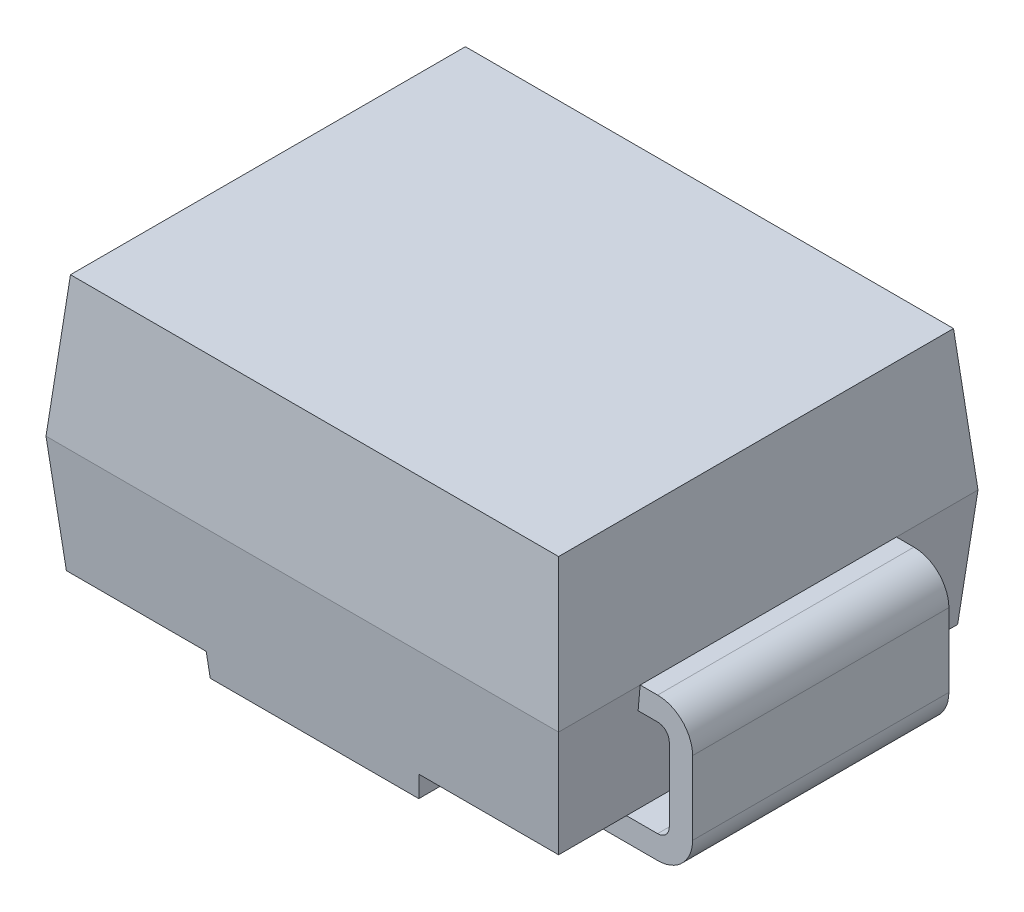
ISO-10303-21;
HEADER;
FILE_DESCRIPTION(('STEP AP214'),'2;1');
FILE_NAME('part.step','',(''),(''),'','','');
FILE_SCHEMA(('AUTOMOTIVE_DESIGN { 1 0 10303 214 1 1 1 1 }'));
ENDSEC;
DATA;
#1=APPLICATION_CONTEXT('core data for automotive mechanical design processes');
#2=APPLICATION_PROTOCOL_DEFINITION('international standard','automotive_design',2000,#1);
#3=PRODUCT_CONTEXT('',#1,'mechanical');
#4=PRODUCT('Part','Part','',(#3));
#5=PRODUCT_RELATED_PRODUCT_CATEGORY('part','',(#4));
#6=PRODUCT_DEFINITION_FORMATION('','',#4);
#7=PRODUCT_DEFINITION_CONTEXT('part definition',#1,'design');
#8=PRODUCT_DEFINITION('design','',#6,#7);
#9=PRODUCT_DEFINITION_SHAPE('','',#8);
#10=(LENGTH_UNIT() NAMED_UNIT(*) SI_UNIT(.MILLI.,.METRE.));
#11=(NAMED_UNIT(*) PLANE_ANGLE_UNIT() SI_UNIT($,.RADIAN.));
#12=(NAMED_UNIT(*) SI_UNIT($,.STERADIAN.) SOLID_ANGLE_UNIT());
#13=UNCERTAINTY_MEASURE_WITH_UNIT(LENGTH_MEASURE(1.E-05),#10,'distance_accuracy_value','');
#14=(GEOMETRIC_REPRESENTATION_CONTEXT(3) GLOBAL_UNCERTAINTY_ASSIGNED_CONTEXT((#13)) GLOBAL_UNIT_ASSIGNED_CONTEXT((#10,
#11,#12)) REPRESENTATION_CONTEXT('',''));
#15=CARTESIAN_POINT('',(0.,0.,0.));
#16=DIRECTION('',(0.,0.,1.));
#17=DIRECTION('',(1.,0.,0.));
#18=AXIS2_PLACEMENT_3D('',#15,#16,#17);
#19=CARTESIAN_POINT('',(2.2,0.,0.));
#20=DIRECTION('',(0.996194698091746,-0.0871557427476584,0.));
#21=DIRECTION('',(0.0871557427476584,0.996194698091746,0.));
#22=AXIS2_PLACEMENT_3D('',#19,#20,#21);
#23=PLANE('',#22);
#24=DIRECTION('',(0.0871557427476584,0.996194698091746,0.));
#25=VECTOR('',#24,1.);
#26=CARTESIAN_POINT('',(2.2,0.,1.1));
#27=LINE('',#26,#25);
#28=CARTESIAN_POINT('',(2.2,0.,1.1));
#29=VERTEX_POINT('',#28);
#30=CARTESIAN_POINT('',(2.18250226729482,-0.2,1.1));
#31=VERTEX_POINT('',#30);
#32=EDGE_CURVE('E431',#29,#31,#27,.F.);
#33=ORIENTED_EDGE('',*,*,#32,.F.);
#34=DIRECTION('',(0.,0.,1.));
#35=VECTOR('',#34,1.);
#36=CARTESIAN_POINT('',(2.2,0.,0.));
#37=LINE('',#36,#35);
#38=CARTESIAN_POINT('',(2.2,0.,1.8));
#39=VERTEX_POINT('',#38);
#40=EDGE_CURVE('E384',#29,#39,#37,.T.);
#41=ORIENTED_EDGE('',*,*,#40,.T.);
#42=DIRECTION('',(0.0868265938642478,0.992432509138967,0.0868265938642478));
#43=VECTOR('',#42,1.);
#44=CARTESIAN_POINT('',(2.14901194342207,-0.582796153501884,1.74901194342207));
#45=LINE('',#44,#43);
#46=CARTESIAN_POINT('',(2.11251133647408,-1.,1.71251133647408));
#47=VERTEX_POINT('',#46);
#48=EDGE_CURVE('E354',#47,#39,#45,.T.);
#49=ORIENTED_EDGE('',*,*,#48,.F.);
#50=DIRECTION('',(0.,0.,-1.));
#51=VECTOR('',#50,1.);
#52=CARTESIAN_POINT('',(2.11251133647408,-1.,0.));
#53=LINE('',#52,#51);
#54=CARTESIAN_POINT('',(2.11251133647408,-1.,-1.71251133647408));
#55=VERTEX_POINT('',#54);
#56=EDGE_CURVE('E359',#55,#47,#53,.F.);
#57=ORIENTED_EDGE('',*,*,#56,.F.);
#58=DIRECTION('',(-0.0868265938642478,-0.992432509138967,0.0868265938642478));
#59=VECTOR('',#58,1.);
#60=CARTESIAN_POINT('',(2.14901194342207,-0.582796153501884,-1.74901194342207));
#61=LINE('',#60,#59);
#62=CARTESIAN_POINT('',(2.2,0.,-1.8));
#63=VERTEX_POINT('',#62);
#64=EDGE_CURVE('E351',#55,#63,#61,.F.);
#65=ORIENTED_EDGE('',*,*,#64,.T.);
#66=CARTESIAN_POINT('',(2.2,0.,-1.1));
#67=VERTEX_POINT('',#66);
#68=EDGE_CURVE('E385',#63,#67,#37,.T.);
#69=ORIENTED_EDGE('',*,*,#68,.T.);
#70=DIRECTION('',(0.0871557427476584,0.996194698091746,0.));
#71=VECTOR('',#70,1.);
#72=CARTESIAN_POINT('',(2.2,0.,-1.1));
#73=LINE('',#72,#71);
#74=CARTESIAN_POINT('',(2.18250226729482,-0.2,-1.1));
#75=VERTEX_POINT('',#74);
#76=EDGE_CURVE('E425',#67,#75,#73,.F.);
#77=ORIENTED_EDGE('',*,*,#76,.T.);
#78=DIRECTION('',(0.,0.,1.));
#79=VECTOR('',#78,1.);
#80=CARTESIAN_POINT('',(2.18250226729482,-0.2,0.));
#81=LINE('',#80,#79);
#82=EDGE_CURVE('E428',#31,#75,#81,.F.);
#83=ORIENTED_EDGE('',*,*,#82,.F.);
#84=EDGE_LOOP('',(#33,#41,#49,#57,#65,#69,#77,#83));
#85=FACE_BOUND('',#84,.T.);
#86=ADVANCED_FACE('F15',(#85),#23,.T.);
#87=CARTESIAN_POINT('',(-4.5633666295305,-1.,0.));
#88=DIRECTION('',(0.,1.,0.));
#89=DIRECTION('',(0.,0.,1.));
#90=AXIS2_PLACEMENT_3D('',#87,#88,#89);
#91=PLANE('',#90);
#92=DIRECTION('',(0.,0.,-1.));
#93=VECTOR('',#92,1.);
#94=CARTESIAN_POINT('',(0.912511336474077,-1.,0.));
#95=LINE('',#94,#93);
#96=CARTESIAN_POINT('',(0.912511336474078,-1.,-1.71251133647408));
#97=VERTEX_POINT('',#96);
#98=CARTESIAN_POINT('',(0.912511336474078,-1.,1.71251133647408));
#99=VERTEX_POINT('',#98);
#100=EDGE_CURVE('E415',#97,#99,#95,.F.);
#101=ORIENTED_EDGE('',*,*,#100,.F.);
#102=DIRECTION('',(-1.,0.,0.));
#103=VECTOR('',#102,1.);
#104=CARTESIAN_POINT('',(-4.5633666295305,-1.,-1.71251133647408));
#105=LINE('',#104,#103);
#106=EDGE_CURVE('E364',#55,#97,#105,.T.);
#107=ORIENTED_EDGE('',*,*,#106,.F.);
#108=ORIENTED_EDGE('',*,*,#56,.T.);
#109=DIRECTION('',(1.,0.,0.));
#110=VECTOR('',#109,1.);
#111=CARTESIAN_POINT('',(-4.5633666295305,-1.,1.71251133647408));
#112=LINE('',#111,#110);
#113=EDGE_CURVE('E369',#47,#99,#112,.F.);
#114=ORIENTED_EDGE('',*,*,#113,.T.);
#115=EDGE_LOOP('',(#101,#107,#108,#114));
#116=FACE_BOUND('',#115,.T.);
#117=ADVANCED_FACE('F517',(#116),#91,.F.);
#118=DIRECTION('',(0.,0.,1.));
#119=VECTOR('',#118,1.);
#120=CARTESIAN_POINT('',(-0.912511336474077,-1.,0.));
#121=LINE('',#120,#119);
#122=CARTESIAN_POINT('',(-0.912511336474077,-1.,1.71251133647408));
#123=VERTEX_POINT('',#122);
#124=CARTESIAN_POINT('',(-0.912511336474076,-1.,-1.71251133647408));
#125=VERTEX_POINT('',#124);
#126=EDGE_CURVE('E393',#123,#125,#121,.F.);
#127=ORIENTED_EDGE('',*,*,#126,.F.);
#128=CARTESIAN_POINT('',(-2.11251133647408,-1.,1.71251133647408));
#129=VERTEX_POINT('',#128);
#130=EDGE_CURVE('E372',#123,#129,#112,.F.);
#131=ORIENTED_EDGE('',*,*,#130,.T.);
#132=DIRECTION('',(0.,0.,1.));
#133=VECTOR('',#132,1.);
#134=CARTESIAN_POINT('',(-2.11251133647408,-1.,0.));
#135=LINE('',#134,#133);
#136=CARTESIAN_POINT('',(-2.11251133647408,-1.,-1.71251133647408));
#137=VERTEX_POINT('',#136);
#138=EDGE_CURVE('E367',#137,#129,#135,.T.);
#139=ORIENTED_EDGE('',*,*,#138,.F.);
#140=EDGE_CURVE('E335',#125,#137,#105,.T.);
#141=ORIENTED_EDGE('',*,*,#140,.F.);
#142=EDGE_LOOP('',(#127,#131,#139,#141));
#143=FACE_BOUND('',#142,.T.);
#144=ADVANCED_FACE('F524',(#143),#91,.F.);
#145=CARTESIAN_POINT('',(-4.5633666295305,0.,-1.8));
#146=DIRECTION('',(0.,0.0871557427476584,-0.996194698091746));
#147=DIRECTION('',(0.,0.996194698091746,0.0871557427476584));
#148=AXIS2_PLACEMENT_3D('',#145,#146,#147);
#149=PLANE('',#148);
#150=DIRECTION('',(-1.,0.,0.));
#151=VECTOR('',#150,1.);
#152=CARTESIAN_POINT('',(-4.5633666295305,0.,-1.8));
#153=LINE('',#152,#151);
#154=CARTESIAN_POINT('',(-2.2,0.,-1.8));
#155=VERTEX_POINT('',#154);
#156=EDGE_CURVE('E353',#63,#155,#153,.T.);
#157=ORIENTED_EDGE('',*,*,#156,.T.);
#158=DIRECTION('',(-0.0868265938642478,-0.992432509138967,-0.0868265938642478));
#159=VECTOR('',#158,1.);
#160=CARTESIAN_POINT('',(-2.18643005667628,0.155105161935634,-1.78643005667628));
#161=LINE('',#160,#159);
#162=CARTESIAN_POINT('',(-2.09501360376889,1.2,-1.69501360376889));
#163=VERTEX_POINT('',#162);
#164=EDGE_CURVE('E390',#163,#155,#161,.T.);
#165=ORIENTED_EDGE('',*,*,#164,.F.);
#166=DIRECTION('',(1.,0.,0.));
#167=VECTOR('',#166,1.);
#168=CARTESIAN_POINT('',(-4.5633666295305,1.2,-1.69501360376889));
#169=LINE('',#168,#167);
#170=CARTESIAN_POINT('',(2.09501360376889,1.2,-1.69501360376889));
#171=VERTEX_POINT('',#170);
#172=EDGE_CURVE('E388',#171,#163,#169,.F.);
#173=ORIENTED_EDGE('',*,*,#172,.F.);
#174=DIRECTION('',(-0.0868265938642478,0.992432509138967,0.0868265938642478));
#175=VECTOR('',#174,1.);
#176=CARTESIAN_POINT('',(2.18643005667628,0.155105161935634,-1.78643005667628));
#177=LINE('',#176,#175);
#178=EDGE_CURVE('E395',#171,#63,#177,.F.);
#179=ORIENTED_EDGE('',*,*,#178,.T.);
#180=EDGE_LOOP('',(#157,#165,#173,#179));
#181=FACE_BOUND('',#180,.T.);
#182=ADVANCED_FACE('F538',(#181),#149,.T.);
#183=CARTESIAN_POINT('',(-2.2,0.,0.));
#184=DIRECTION('',(-0.996194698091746,0.0871557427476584,0.));
#185=DIRECTION('',(-0.0871557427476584,-0.996194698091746,0.));
#186=AXIS2_PLACEMENT_3D('',#183,#184,#185);
#187=PLANE('',#186);
#188=DIRECTION('',(0.,0.,1.));
#189=VECTOR('',#188,1.);
#190=CARTESIAN_POINT('',(-2.2,0.,0.));
#191=LINE('',#190,#189);
#192=CARTESIAN_POINT('',(-2.2,0.,-1.1));
#193=VERTEX_POINT('',#192);
#194=EDGE_CURVE('E377',#155,#193,#191,.T.);
#195=ORIENTED_EDGE('',*,*,#194,.T.);
#196=CARTESIAN_POINT('',(-2.2,0.,1.1));
#197=VERTEX_POINT('',#196);
#198=EDGE_CURVE('E381',#193,#197,#191,.T.);
#199=ORIENTED_EDGE('',*,*,#198,.T.);
#200=CARTESIAN_POINT('',(-2.2,0.,1.8));
#201=VERTEX_POINT('',#200);
#202=EDGE_CURVE('E376',#197,#201,#191,.T.);
#203=ORIENTED_EDGE('',*,*,#202,.T.);
#204=DIRECTION('',(0.0868265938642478,0.992432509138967,-0.0868265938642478));
#205=VECTOR('',#204,1.);
#206=CARTESIAN_POINT('',(-2.18643005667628,0.155105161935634,1.78643005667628));
#207=LINE('',#206,#205);
#208=CARTESIAN_POINT('',(-2.09501360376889,1.2,1.69501360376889));
#209=VERTEX_POINT('',#208);
#210=EDGE_CURVE('E394',#209,#201,#207,.F.);
#211=ORIENTED_EDGE('',*,*,#210,.F.);
#212=DIRECTION('',(0.,0.,-1.));
#213=VECTOR('',#212,1.);
#214=CARTESIAN_POINT('',(-2.09501360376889,1.2,0.));
#215=LINE('',#214,#213);
#216=EDGE_CURVE('E406',#163,#209,#215,.F.);
#217=ORIENTED_EDGE('',*,*,#216,.F.);
#218=ORIENTED_EDGE('',*,*,#164,.T.);
#219=EDGE_LOOP('',(#195,#199,#203,#211,#217,#218));
#220=FACE_BOUND('',#219,.T.);
#221=ADVANCED_FACE('F541',(#220),#187,.T.);
#222=CARTESIAN_POINT('',(-4.5633666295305,0.,1.8));
#223=DIRECTION('',(0.,0.0871557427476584,0.996194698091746));
#224=DIRECTION('',(0.,-0.996194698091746,0.0871557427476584));
#225=AXIS2_PLACEMENT_3D('',#222,#223,#224);
#226=PLANE('',#225);
#227=DIRECTION('',(-1.,0.,0.));
#228=VECTOR('',#227,1.);
#229=CARTESIAN_POINT('',(-4.5633666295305,0.,1.8));
#230=LINE('',#229,#228);
#231=EDGE_CURVE('E380',#39,#201,#230,.T.);
#232=ORIENTED_EDGE('',*,*,#231,.F.);
#233=DIRECTION('',(0.0868265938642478,-0.992432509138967,0.0868265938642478));
#234=VECTOR('',#233,1.);
#235=CARTESIAN_POINT('',(2.18643005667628,0.155105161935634,1.78643005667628));
#236=LINE('',#235,#234);
#237=CARTESIAN_POINT('',(2.09501360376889,1.2,1.69501360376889));
#238=VERTEX_POINT('',#237);
#239=EDGE_CURVE('E398',#238,#39,#236,.T.);
#240=ORIENTED_EDGE('',*,*,#239,.F.);
#241=DIRECTION('',(-1.,0.,0.));
#242=VECTOR('',#241,1.);
#243=CARTESIAN_POINT('',(-4.5633666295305,1.2,1.69501360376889));
#244=LINE('',#243,#242);
#245=EDGE_CURVE('E408',#238,#209,#244,.T.);
#246=ORIENTED_EDGE('',*,*,#245,.T.);
#247=ORIENTED_EDGE('',*,*,#210,.T.);
#248=EDGE_LOOP('',(#232,#240,#246,#247));
#249=FACE_BOUND('',#248,.T.);
#250=ADVANCED_FACE('F545',(#249),#226,.T.);
#251=CARTESIAN_POINT('',(2.2,0.,0.));
#252=DIRECTION('',(0.996194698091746,0.0871557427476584,0.));
#253=DIRECTION('',(-0.0871557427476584,0.996194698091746,0.));
#254=AXIS2_PLACEMENT_3D('',#251,#252,#253);
#255=PLANE('',#254);
#256=ORIENTED_EDGE('',*,*,#68,.F.);
#257=ORIENTED_EDGE('',*,*,#178,.F.);
#258=DIRECTION('',(0.,0.,1.));
#259=VECTOR('',#258,1.);
#260=CARTESIAN_POINT('',(2.09501360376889,1.2,0.));
#261=LINE('',#260,#259);
#262=EDGE_CURVE('E399',#171,#238,#261,.T.);
#263=ORIENTED_EDGE('',*,*,#262,.T.);
#264=ORIENTED_EDGE('',*,*,#239,.T.);
#265=ORIENTED_EDGE('',*,*,#40,.F.);
#266=EDGE_CURVE('E389',#67,#29,#37,.T.);
#267=ORIENTED_EDGE('',*,*,#266,.F.);
#268=EDGE_LOOP('',(#256,#257,#263,#264,#265,#267));
#269=FACE_BOUND('',#268,.T.);
#270=ADVANCED_FACE('F536',(#269),#255,.T.);
#271=CARTESIAN_POINT('',(-4.5633666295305,1.2,0.));
#272=DIRECTION('',(0.,1.,0.));
#273=DIRECTION('',(0.,0.,1.));
#274=AXIS2_PLACEMENT_3D('',#271,#272,#273);
#275=PLANE('',#274);
#276=ORIENTED_EDGE('',*,*,#172,.T.);
#277=ORIENTED_EDGE('',*,*,#216,.T.);
#278=ORIENTED_EDGE('',*,*,#245,.F.);
#279=ORIENTED_EDGE('',*,*,#262,.F.);
#280=EDGE_LOOP('',(#276,#277,#278,#279));
#281=FACE_BOUND('',#280,.T.);
#282=ADVANCED_FACE('F532',(#281),#275,.T.);
#283=CARTESIAN_POINT('',(-4.5633666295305,0.,-1.8));
#284=DIRECTION('',(0.,-0.0871557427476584,-0.996194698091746));
#285=DIRECTION('',(0.,0.996194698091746,-0.0871557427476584));
#286=AXIS2_PLACEMENT_3D('',#283,#284,#285);
#287=PLANE('',#286);
#288=DIRECTION('',(-0.0868265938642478,0.992432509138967,-0.0868265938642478));
#289=VECTOR('',#288,1.);
#290=CARTESIAN_POINT('',(-2.21781708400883,0.203650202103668,-1.81781708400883));
#291=LINE('',#290,#289);
#292=EDGE_CURVE('E355',#137,#155,#291,.T.);
#293=ORIENTED_EDGE('',*,*,#292,.T.);
#294=ORIENTED_EDGE('',*,*,#156,.F.);
#295=ORIENTED_EDGE('',*,*,#64,.F.);
#296=ORIENTED_EDGE('',*,*,#106,.T.);
#297=DIRECTION('',(-0.0868265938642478,-0.992432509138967,0.0868265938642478));
#298=VECTOR('',#297,1.);
#299=CARTESIAN_POINT('',(0.958058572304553,-0.479392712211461,-1.75805857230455));
#300=LINE('',#299,#298);
#301=CARTESIAN_POINT('',(0.895013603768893,-1.2,-1.69501360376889));
#302=VERTEX_POINT('',#301);
#303=EDGE_CURVE('E337',#302,#97,#300,.F.);
#304=ORIENTED_EDGE('',*,*,#303,.F.);
#305=DIRECTION('',(-1.,0.,0.));
#306=VECTOR('',#305,1.);
#307=CARTESIAN_POINT('',(-4.5633666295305,-1.2,-1.69501360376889));
#308=LINE('',#307,#306);
#309=CARTESIAN_POINT('',(-0.895013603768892,-1.2,-1.69501360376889));
#310=VERTEX_POINT('',#309);
#311=EDGE_CURVE('E345',#302,#310,#308,.T.);
#312=ORIENTED_EDGE('',*,*,#311,.T.);
#313=DIRECTION('',(0.0868265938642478,-0.992432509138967,0.0868265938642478));
#314=VECTOR('',#313,1.);
#315=CARTESIAN_POINT('',(-0.98643005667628,-0.155105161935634,-1.78643005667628));
#316=LINE('',#315,#314);
#317=EDGE_CURVE('E339',#310,#125,#316,.F.);
#318=ORIENTED_EDGE('',*,*,#317,.T.);
#319=ORIENTED_EDGE('',*,*,#140,.T.);
#320=EDGE_LOOP('',(#293,#294,#295,#296,#304,#312,#318,#319));
#321=FACE_BOUND('',#320,.T.);
#322=ADVANCED_FACE('F535',(#321),#287,.T.);
#323=CARTESIAN_POINT('',(-4.5633666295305,0.,1.8));
#324=DIRECTION('',(0.,-0.0871557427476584,0.996194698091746));
#325=DIRECTION('',(0.,-0.996194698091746,-0.0871557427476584));
#326=AXIS2_PLACEMENT_3D('',#323,#324,#325);
#327=PLANE('',#326);
#328=ORIENTED_EDGE('',*,*,#231,.T.);
#329=DIRECTION('',(0.0868265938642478,-0.992432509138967,-0.0868265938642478));
#330=VECTOR('',#329,1.);
#331=CARTESIAN_POINT('',(-2.21781708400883,0.203650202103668,1.81781708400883));
#332=LINE('',#331,#330);
#333=EDGE_CURVE('E358',#129,#201,#332,.F.);
#334=ORIENTED_EDGE('',*,*,#333,.F.);
#335=ORIENTED_EDGE('',*,*,#130,.F.);
#336=DIRECTION('',(-0.0868265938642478,0.992432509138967,0.0868265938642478));
#337=VECTOR('',#336,1.);
#338=CARTESIAN_POINT('',(-0.98643005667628,-0.155105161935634,1.78643005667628));
#339=LINE('',#338,#337);
#340=CARTESIAN_POINT('',(-0.895013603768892,-1.2,1.69501360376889));
#341=VERTEX_POINT('',#340);
#342=EDGE_CURVE('E336',#341,#123,#339,.T.);
#343=ORIENTED_EDGE('',*,*,#342,.F.);
#344=DIRECTION('',(1.,0.,0.));
#345=VECTOR('',#344,1.);
#346=CARTESIAN_POINT('',(-4.5633666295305,-1.2,1.69501360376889));
#347=LINE('',#346,#345);
#348=CARTESIAN_POINT('',(0.895013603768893,-1.2,1.69501360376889));
#349=VERTEX_POINT('',#348);
#350=EDGE_CURVE('E340',#349,#341,#347,.F.);
#351=ORIENTED_EDGE('',*,*,#350,.F.);
#352=DIRECTION('',(0.0868265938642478,0.992432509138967,0.0868265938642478));
#353=VECTOR('',#352,1.);
#354=CARTESIAN_POINT('',(0.958058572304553,-0.479392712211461,1.75805857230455));
#355=LINE('',#354,#353);
#356=EDGE_CURVE('E332',#349,#99,#355,.T.);
#357=ORIENTED_EDGE('',*,*,#356,.T.);
#358=ORIENTED_EDGE('',*,*,#113,.F.);
#359=ORIENTED_EDGE('',*,*,#48,.T.);
#360=EDGE_LOOP('',(#328,#334,#335,#343,#351,#357,#358,#359));
#361=FACE_BOUND('',#360,.T.);
#362=ADVANCED_FACE('F530',(#361),#327,.T.);
#363=CARTESIAN_POINT('',(-2.2,0.,0.));
#364=DIRECTION('',(-0.996194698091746,-0.0871557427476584,0.));
#365=DIRECTION('',(0.0871557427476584,-0.996194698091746,0.));
#366=AXIS2_PLACEMENT_3D('',#363,#364,#365);
#367=PLANE('',#366);
#368=DIRECTION('',(-0.0871557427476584,0.996194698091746,0.));
#369=VECTOR('',#368,1.);
#370=CARTESIAN_POINT('',(-2.2,0.,1.1));
#371=LINE('',#370,#369);
#372=CARTESIAN_POINT('',(-2.18250226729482,-0.2,1.1));
#373=VERTEX_POINT('',#372);
#374=EDGE_CURVE('E423',#373,#197,#371,.T.);
#375=ORIENTED_EDGE('',*,*,#374,.F.);
#376=DIRECTION('',(0.,0.,-1.));
#377=VECTOR('',#376,1.);
#378=CARTESIAN_POINT('',(-2.18250226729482,-0.2,0.));
#379=LINE('',#378,#377);
#380=CARTESIAN_POINT('',(-2.18250226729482,-0.2,-1.1));
#381=VERTEX_POINT('',#380);
#382=EDGE_CURVE('E420',#373,#381,#379,.T.);
#383=ORIENTED_EDGE('',*,*,#382,.T.);
#384=DIRECTION('',(-0.0871557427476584,0.996194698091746,0.));
#385=VECTOR('',#384,1.);
#386=CARTESIAN_POINT('',(-2.2,0.,-1.1));
#387=LINE('',#386,#385);
#388=EDGE_CURVE('E417',#381,#193,#387,.T.);
#389=ORIENTED_EDGE('',*,*,#388,.T.);
#390=ORIENTED_EDGE('',*,*,#194,.F.);
#391=ORIENTED_EDGE('',*,*,#292,.F.);
#392=ORIENTED_EDGE('',*,*,#138,.T.);
#393=ORIENTED_EDGE('',*,*,#333,.T.);
#394=ORIENTED_EDGE('',*,*,#202,.F.);
#395=EDGE_LOOP('',(#375,#383,#389,#390,#391,#392,#393,#394));
#396=FACE_BOUND('',#395,.T.);
#397=ADVANCED_FACE('F616',(#396),#367,.T.);
#398=CARTESIAN_POINT('',(1.,0.,0.));
#399=DIRECTION('',(0.996194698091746,-0.0871557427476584,0.));
#400=DIRECTION('',(0.0871557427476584,0.996194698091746,0.));
#401=AXIS2_PLACEMENT_3D('',#398,#399,#400);
#402=PLANE('',#401);
#403=ORIENTED_EDGE('',*,*,#303,.T.);
#404=ORIENTED_EDGE('',*,*,#100,.T.);
#405=ORIENTED_EDGE('',*,*,#356,.F.);
#406=DIRECTION('',(0.,0.,-1.));
#407=VECTOR('',#406,1.);
#408=CARTESIAN_POINT('',(0.895013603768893,-1.2,0.));
#409=LINE('',#408,#407);
#410=EDGE_CURVE('E331',#302,#349,#409,.F.);
#411=ORIENTED_EDGE('',*,*,#410,.F.);
#412=EDGE_LOOP('',(#403,#404,#405,#411));
#413=FACE_BOUND('',#412,.T.);
#414=ADVANCED_FACE('F633',(#413),#402,.T.);
#415=CARTESIAN_POINT('',(-1.,0.,0.));
#416=DIRECTION('',(-0.996194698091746,-0.0871557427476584,0.));
#417=DIRECTION('',(0.0871557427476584,-0.996194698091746,0.));
#418=AXIS2_PLACEMENT_3D('',#415,#416,#417);
#419=PLANE('',#418);
#420=ORIENTED_EDGE('',*,*,#342,.T.);
#421=ORIENTED_EDGE('',*,*,#126,.T.);
#422=ORIENTED_EDGE('',*,*,#317,.F.);
#423=DIRECTION('',(0.,0.,1.));
#424=VECTOR('',#423,1.);
#425=CARTESIAN_POINT('',(-0.895013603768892,-1.2,0.));
#426=LINE('',#425,#424);
#427=EDGE_CURVE('E347',#341,#310,#426,.F.);
#428=ORIENTED_EDGE('',*,*,#427,.F.);
#429=EDGE_LOOP('',(#420,#421,#422,#428));
#430=FACE_BOUND('',#429,.T.);
#431=ADVANCED_FACE('F626',(#430),#419,.T.);
#432=CARTESIAN_POINT('',(-4.5633666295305,-1.2,0.));
#433=DIRECTION('',(0.,1.,0.));
#434=DIRECTION('',(0.,0.,1.));
#435=AXIS2_PLACEMENT_3D('',#432,#433,#434);
#436=PLANE('',#435);
#437=ORIENTED_EDGE('',*,*,#410,.T.);
#438=ORIENTED_EDGE('',*,*,#350,.T.);
#439=ORIENTED_EDGE('',*,*,#427,.T.);
#440=ORIENTED_EDGE('',*,*,#311,.F.);
#441=EDGE_LOOP('',(#437,#438,#439,#440));
#442=FACE_BOUND('',#441,.T.);
#443=ADVANCED_FACE('F629',(#442),#436,.F.);
#444=CARTESIAN_POINT('',(-2.2,0.,1.1));
#445=DIRECTION('',(0.,-1.,0.));
#446=DIRECTION('',(1.,0.,0.));
#447=AXIS2_PLACEMENT_3D('',#444,#445,#446);
#448=PLANE('',#447);
#449=DIRECTION('',(-1.,0.,0.));
#450=VECTOR('',#449,1.);
#451=CARTESIAN_POINT('',(-1.85233263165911,0.,-1.1));
#452=LINE('',#451,#450);
#453=CARTESIAN_POINT('',(-2.35,0.,-1.1));
#454=VERTEX_POINT('',#453);
#455=EDGE_CURVE('E258',#193,#454,#452,.T.);
#456=ORIENTED_EDGE('',*,*,#455,.T.);
#457=DIRECTION('',(0.,0.,-1.));
#458=VECTOR('',#457,1.);
#459=CARTESIAN_POINT('',(-2.35,0.,1.1));
#460=LINE('',#459,#458);
#461=CARTESIAN_POINT('',(-2.35,0.,1.1));
#462=VERTEX_POINT('',#461);
#463=EDGE_CURVE('E476',#454,#462,#460,.F.);
#464=ORIENTED_EDGE('',*,*,#463,.T.);
#465=DIRECTION('',(-1.,0.,0.));
#466=VECTOR('',#465,1.);
#467=CARTESIAN_POINT('',(-1.85233263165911,0.,1.1));
#468=LINE('',#467,#466);
#469=EDGE_CURVE('E308',#197,#462,#468,.T.);
#470=ORIENTED_EDGE('',*,*,#469,.F.);
#471=ORIENTED_EDGE('',*,*,#198,.F.);
#472=EDGE_LOOP('',(#456,#464,#470,#471));
#473=FACE_BOUND('',#472,.T.);
#474=ADVANCED_FACE('F692',(#473),#448,.F.);
#475=CARTESIAN_POINT('',(-2.65,0.,1.1));
#476=DIRECTION('',(1.,0.,0.));
#477=DIRECTION('',(0.,0.,-1.));
#478=AXIS2_PLACEMENT_3D('',#475,#476,#477);
#479=PLANE('',#478);
#480=DIRECTION('',(0.,-1.,0.));
#481=VECTOR('',#480,1.);
#482=CARTESIAN_POINT('',(-2.65,0.,1.1));
#483=LINE('',#482,#481);
#484=CARTESIAN_POINT('',(-2.65,-0.3,1.1));
#485=VERTEX_POINT('',#484);
#486=CARTESIAN_POINT('',(-2.65,-0.93,1.1));
#487=VERTEX_POINT('',#486);
#488=EDGE_CURVE('E311',#485,#487,#483,.T.);
#489=ORIENTED_EDGE('',*,*,#488,.F.);
#490=DIRECTION('',(0.,0.,-1.));
#491=VECTOR('',#490,1.);
#492=CARTESIAN_POINT('',(-2.65,-0.3,1.1));
#493=LINE('',#492,#491);
#494=CARTESIAN_POINT('',(-2.65,-0.3,-1.1));
#495=VERTEX_POINT('',#494);
#496=EDGE_CURVE('E469',#485,#495,#493,.T.);
#497=ORIENTED_EDGE('',*,*,#496,.T.);
#498=DIRECTION('',(0.,-1.,0.));
#499=VECTOR('',#498,1.);
#500=CARTESIAN_POINT('',(-2.65,0.,-1.1));
#501=LINE('',#500,#499);
#502=CARTESIAN_POINT('',(-2.65,-0.93,-1.1));
#503=VERTEX_POINT('',#502);
#504=EDGE_CURVE('E292',#495,#503,#501,.T.);
#505=ORIENTED_EDGE('',*,*,#504,.T.);
#506=DIRECTION('',(0.,0.,-1.));
#507=VECTOR('',#506,1.);
#508=CARTESIAN_POINT('',(-2.65,-0.93,1.1));
#509=LINE('',#508,#507);
#510=EDGE_CURVE('E467',#503,#487,#509,.F.);
#511=ORIENTED_EDGE('',*,*,#510,.T.);
#512=EDGE_LOOP('',(#489,#497,#505,#511));
#513=FACE_BOUND('',#512,.T.);
#514=ADVANCED_FACE('F688',(#513),#479,.F.);
#515=CARTESIAN_POINT('',(-2.65,-1.23,1.1));
#516=DIRECTION('',(0.,1.,0.));
#517=DIRECTION('',(0.,0.,1.));
#518=AXIS2_PLACEMENT_3D('',#515,#516,#517);
#519=PLANE('',#518);
#520=DIRECTION('',(1.,0.,0.));
#521=VECTOR('',#520,1.);
#522=CARTESIAN_POINT('',(-2.65,-1.23,1.1));
#523=LINE('',#522,#521);
#524=CARTESIAN_POINT('',(-2.35,-1.23,1.1));
#525=VERTEX_POINT('',#524);
#526=CARTESIAN_POINT('',(-1.15,-1.23,1.1));
#527=VERTEX_POINT('',#526);
#528=EDGE_CURVE('E314',#525,#527,#523,.T.);
#529=ORIENTED_EDGE('',*,*,#528,.F.);
#530=DIRECTION('',(0.,0.,-1.));
#531=VECTOR('',#530,1.);
#532=CARTESIAN_POINT('',(-2.35,-1.23,1.1));
#533=LINE('',#532,#531);
#534=CARTESIAN_POINT('',(-2.35,-1.23,-1.1));
#535=VERTEX_POINT('',#534);
#536=EDGE_CURVE('E482',#525,#535,#533,.T.);
#537=ORIENTED_EDGE('',*,*,#536,.T.);
#538=DIRECTION('',(1.,0.,0.));
#539=VECTOR('',#538,1.);
#540=CARTESIAN_POINT('',(-2.65,-1.23,-1.1));
#541=LINE('',#540,#539);
#542=CARTESIAN_POINT('',(-1.15,-1.23,-1.1));
#543=VERTEX_POINT('',#542);
#544=EDGE_CURVE('E295',#535,#543,#541,.T.);
#545=ORIENTED_EDGE('',*,*,#544,.T.);
#546=DIRECTION('',(0.,0.,-1.));
#547=VECTOR('',#546,1.);
#548=CARTESIAN_POINT('',(-1.15,-1.23,1.1));
#549=LINE('',#548,#547);
#550=EDGE_CURVE('E328',#527,#543,#549,.T.);
#551=ORIENTED_EDGE('',*,*,#550,.F.);
#552=EDGE_LOOP('',(#529,#537,#545,#551));
#553=FACE_BOUND('',#552,.T.);
#554=ADVANCED_FACE('F684',(#553),#519,.F.);
#555=CARTESIAN_POINT('',(-1.15,-1.23,1.1));
#556=DIRECTION('',(-1.,0.,0.));
#557=DIRECTION('',(0.,0.,1.));
#558=AXIS2_PLACEMENT_3D('',#555,#556,#557);
#559=PLANE('',#558);
#560=ORIENTED_EDGE('',*,*,#550,.T.);
#561=DIRECTION('',(0.,1.,0.));
#562=VECTOR('',#561,1.);
#563=CARTESIAN_POINT('',(-1.15,-1.23,-1.1));
#564=LINE('',#563,#562);
#565=CARTESIAN_POINT('',(-1.15,-1.03,-1.1));
#566=VERTEX_POINT('',#565);
#567=EDGE_CURVE('E297',#543,#566,#564,.T.);
#568=ORIENTED_EDGE('',*,*,#567,.T.);
#569=DIRECTION('',(0.,0.,-1.));
#570=VECTOR('',#569,1.);
#571=CARTESIAN_POINT('',(-1.15,-1.03,1.1));
#572=LINE('',#571,#570);
#573=CARTESIAN_POINT('',(-1.15,-1.03,1.1));
#574=VERTEX_POINT('',#573);
#575=EDGE_CURVE('E326',#574,#566,#572,.T.);
#576=ORIENTED_EDGE('',*,*,#575,.F.);
#577=DIRECTION('',(0.,1.,0.));
#578=VECTOR('',#577,1.);
#579=CARTESIAN_POINT('',(-1.15,-1.23,1.1));
#580=LINE('',#579,#578);
#581=EDGE_CURVE('E316',#527,#574,#580,.T.);
#582=ORIENTED_EDGE('',*,*,#581,.F.);
#583=EDGE_LOOP('',(#560,#568,#576,#582));
#584=FACE_BOUND('',#583,.T.);
#585=ADVANCED_FACE('F680',(#584),#559,.F.);
#586=CARTESIAN_POINT('',(-1.15,-1.03,1.1));
#587=DIRECTION('',(0.,-1.,0.));
#588=DIRECTION('',(1.,0.,0.));
#589=AXIS2_PLACEMENT_3D('',#586,#587,#588);
#590=PLANE('',#589);
#591=DIRECTION('',(-1.,0.,0.));
#592=VECTOR('',#591,1.);
#593=CARTESIAN_POINT('',(-1.15,-1.03,-1.1));
#594=LINE('',#593,#592);
#595=CARTESIAN_POINT('',(-2.35,-1.03,-1.1));
#596=VERTEX_POINT('',#595);
#597=EDGE_CURVE('E300',#566,#596,#594,.T.);
#598=ORIENTED_EDGE('',*,*,#597,.T.);
#599=DIRECTION('',(0.,0.,-1.));
#600=VECTOR('',#599,1.);
#601=CARTESIAN_POINT('',(-2.35,-1.03,1.1));
#602=LINE('',#601,#600);
#603=CARTESIAN_POINT('',(-2.35,-1.03,1.1));
#604=VERTEX_POINT('',#603);
#605=EDGE_CURVE('E441',#596,#604,#602,.F.);
#606=ORIENTED_EDGE('',*,*,#605,.T.);
#607=DIRECTION('',(-1.,0.,0.));
#608=VECTOR('',#607,1.);
#609=CARTESIAN_POINT('',(-1.15,-1.03,1.1));
#610=LINE('',#609,#608);
#611=EDGE_CURVE('E318',#574,#604,#610,.T.);
#612=ORIENTED_EDGE('',*,*,#611,.F.);
#613=ORIENTED_EDGE('',*,*,#575,.T.);
#614=EDGE_LOOP('',(#598,#606,#612,#613));
#615=FACE_BOUND('',#614,.T.);
#616=ADVANCED_FACE('F676',(#615),#590,.F.);
#617=CARTESIAN_POINT('',(-2.45,-1.03,1.1));
#618=DIRECTION('',(-1.,0.,0.));
#619=DIRECTION('',(0.,-1.,0.));
#620=AXIS2_PLACEMENT_3D('',#617,#618,#619);
#621=PLANE('',#620);
#622=DIRECTION('',(0.,1.,0.));
#623=VECTOR('',#622,1.);
#624=CARTESIAN_POINT('',(-2.45,-1.03,-1.1));
#625=LINE('',#624,#623);
#626=CARTESIAN_POINT('',(-2.45,-0.93,-1.1));
#627=VERTEX_POINT('',#626);
#628=CARTESIAN_POINT('',(-2.45,-0.3,-1.1));
#629=VERTEX_POINT('',#628);
#630=EDGE_CURVE('E303',#627,#629,#625,.T.);
#631=ORIENTED_EDGE('',*,*,#630,.T.);
#632=DIRECTION('',(0.,0.,-1.));
#633=VECTOR('',#632,1.);
#634=CARTESIAN_POINT('',(-2.45,-0.3,1.1));
#635=LINE('',#634,#633);
#636=CARTESIAN_POINT('',(-2.45,-0.3,1.1));
#637=VERTEX_POINT('',#636);
#638=EDGE_CURVE('E439',#629,#637,#635,.F.);
#639=ORIENTED_EDGE('',*,*,#638,.T.);
#640=DIRECTION('',(0.,1.,0.));
#641=VECTOR('',#640,1.);
#642=CARTESIAN_POINT('',(-2.45,-1.03,1.1));
#643=LINE('',#642,#641);
#644=CARTESIAN_POINT('',(-2.45,-0.93,1.1));
#645=VERTEX_POINT('',#644);
#646=EDGE_CURVE('E321',#645,#637,#643,.T.);
#647=ORIENTED_EDGE('',*,*,#646,.F.);
#648=DIRECTION('',(0.,0.,-1.));
#649=VECTOR('',#648,1.);
#650=CARTESIAN_POINT('',(-2.45,-0.93,-1.1));
#651=LINE('',#650,#649);
#652=EDGE_CURVE('E436',#645,#627,#651,.T.);
#653=ORIENTED_EDGE('',*,*,#652,.T.);
#654=EDGE_LOOP('',(#631,#639,#647,#653));
#655=FACE_BOUND('',#654,.T.);
#656=ADVANCED_FACE('F672',(#655),#621,.F.);
#657=CARTESIAN_POINT('',(-2.45,-0.2,1.1));
#658=DIRECTION('',(0.,1.,0.));
#659=DIRECTION('',(0.,0.,1.));
#660=AXIS2_PLACEMENT_3D('',#657,#658,#659);
#661=PLANE('',#660);
#662=DIRECTION('',(1.,0.,0.));
#663=VECTOR('',#662,1.);
#664=CARTESIAN_POINT('',(-2.45,-0.2,1.1));
#665=LINE('',#664,#663);
#666=CARTESIAN_POINT('',(-2.35,-0.2,1.1));
#667=VERTEX_POINT('',#666);
#668=EDGE_CURVE('E324',#667,#373,#665,.T.);
#669=ORIENTED_EDGE('',*,*,#668,.F.);
#670=DIRECTION('',(0.,0.,-1.));
#671=VECTOR('',#670,1.);
#672=CARTESIAN_POINT('',(-2.35,-0.2,-1.1));
#673=LINE('',#672,#671);
#674=CARTESIAN_POINT('',(-2.35,-0.2,-1.1));
#675=VERTEX_POINT('',#674);
#676=EDGE_CURVE('E433',#667,#675,#673,.T.);
#677=ORIENTED_EDGE('',*,*,#676,.T.);
#678=DIRECTION('',(1.,0.,0.));
#679=VECTOR('',#678,1.);
#680=CARTESIAN_POINT('',(-2.45,-0.2,-1.1));
#681=LINE('',#680,#679);
#682=EDGE_CURVE('E306',#675,#381,#681,.T.);
#683=ORIENTED_EDGE('',*,*,#682,.T.);
#684=ORIENTED_EDGE('',*,*,#382,.F.);
#685=EDGE_LOOP('',(#669,#677,#683,#684));
#686=FACE_BOUND('',#685,.T.);
#687=ADVANCED_FACE('F668',(#686),#661,.F.);
#688=CARTESIAN_POINT('',(-2.65,0.,1.1));
#689=DIRECTION('',(0.,0.,1.));
#690=DIRECTION('',(1.,0.,0.));
#691=AXIS2_PLACEMENT_3D('',#688,#689,#690);
#692=PLANE('',#691);
#693=ORIENTED_EDGE('',*,*,#469,.T.);
#694=CARTESIAN_POINT('',(-2.35,-0.3,1.1));
#695=DIRECTION('',(0.,0.,1.));
#696=DIRECTION('',(1.,0.,0.));
#697=AXIS2_PLACEMENT_3D('',#694,#695,#696);
#698=CIRCLE('',#697,0.3);
#699=EDGE_CURVE('E480',#462,#485,#698,.T.);
#700=ORIENTED_EDGE('',*,*,#699,.T.);
#701=ORIENTED_EDGE('',*,*,#488,.T.);
#702=CARTESIAN_POINT('',(-2.35,-0.93,1.1));
#703=DIRECTION('',(0.,0.,1.));
#704=DIRECTION('',(1.,0.,0.));
#705=AXIS2_PLACEMENT_3D('',#702,#703,#704);
#706=CIRCLE('',#705,0.3);
#707=EDGE_CURVE('E478',#487,#525,#706,.T.);
#708=ORIENTED_EDGE('',*,*,#707,.T.);
#709=ORIENTED_EDGE('',*,*,#528,.T.);
#710=ORIENTED_EDGE('',*,*,#581,.T.);
#711=ORIENTED_EDGE('',*,*,#611,.T.);
#712=CARTESIAN_POINT('',(-2.35,-0.93,1.1));
#713=DIRECTION('',(0.,0.,1.));
#714=DIRECTION('',(1.,0.,0.));
#715=AXIS2_PLACEMENT_3D('',#712,#713,#714);
#716=CIRCLE('',#715,0.1);
#717=EDGE_CURVE('E457',#604,#645,#716,.F.);
#718=ORIENTED_EDGE('',*,*,#717,.T.);
#719=ORIENTED_EDGE('',*,*,#646,.T.);
#720=CARTESIAN_POINT('',(-2.35,-0.3,1.1));
#721=DIRECTION('',(0.,0.,1.));
#722=DIRECTION('',(1.,0.,0.));
#723=AXIS2_PLACEMENT_3D('',#720,#721,#722);
#724=CIRCLE('',#723,0.1);
#725=EDGE_CURVE('E453',#637,#667,#724,.F.);
#726=ORIENTED_EDGE('',*,*,#725,.T.);
#727=ORIENTED_EDGE('',*,*,#668,.T.);
#728=ORIENTED_EDGE('',*,*,#374,.T.);
#729=EDGE_LOOP('',(#693,#700,#701,#708,#709,#710,#711,#718,#719,#726,#727,#728));
#730=FACE_BOUND('',#729,.T.);
#731=ADVANCED_FACE('F664',(#730),#692,.T.);
#732=CARTESIAN_POINT('',(-2.65,0.,-1.1));
#733=DIRECTION('',(0.,0.,1.));
#734=DIRECTION('',(1.,0.,0.));
#735=AXIS2_PLACEMENT_3D('',#732,#733,#734);
#736=PLANE('',#735);
#737=ORIENTED_EDGE('',*,*,#504,.F.);
#738=CARTESIAN_POINT('',(-2.35,-0.3,-1.1));
#739=DIRECTION('',(0.,0.,1.));
#740=DIRECTION('',(1.,0.,0.));
#741=AXIS2_PLACEMENT_3D('',#738,#739,#740);
#742=CIRCLE('',#741,0.3);
#743=EDGE_CURVE('E474',#495,#454,#742,.F.);
#744=ORIENTED_EDGE('',*,*,#743,.T.);
#745=ORIENTED_EDGE('',*,*,#455,.F.);
#746=ORIENTED_EDGE('',*,*,#388,.F.);
#747=ORIENTED_EDGE('',*,*,#682,.F.);
#748=CARTESIAN_POINT('',(-2.35,-0.3,-1.1));
#749=DIRECTION('',(0.,0.,1.));
#750=DIRECTION('',(1.,0.,0.));
#751=AXIS2_PLACEMENT_3D('',#748,#749,#750);
#752=CIRCLE('',#751,0.1);
#753=EDGE_CURVE('E451',#675,#629,#752,.T.);
#754=ORIENTED_EDGE('',*,*,#753,.T.);
#755=ORIENTED_EDGE('',*,*,#630,.F.);
#756=CARTESIAN_POINT('',(-2.35,-0.93,-1.1));
#757=DIRECTION('',(0.,0.,1.));
#758=DIRECTION('',(1.,0.,0.));
#759=AXIS2_PLACEMENT_3D('',#756,#757,#758);
#760=CIRCLE('',#759,0.1);
#761=EDGE_CURVE('E455',#627,#596,#760,.T.);
#762=ORIENTED_EDGE('',*,*,#761,.T.);
#763=ORIENTED_EDGE('',*,*,#597,.F.);
#764=ORIENTED_EDGE('',*,*,#567,.F.);
#765=ORIENTED_EDGE('',*,*,#544,.F.);
#766=CARTESIAN_POINT('',(-2.35,-0.93,-1.1));
#767=DIRECTION('',(0.,0.,1.));
#768=DIRECTION('',(1.,0.,0.));
#769=AXIS2_PLACEMENT_3D('',#766,#767,#768);
#770=CIRCLE('',#769,0.3);
#771=EDGE_CURVE('E472',#535,#503,#770,.F.);
#772=ORIENTED_EDGE('',*,*,#771,.T.);
#773=EDGE_LOOP('',(#737,#744,#745,#746,#747,#754,#755,#762,#763,#764,#765,#772));
#774=FACE_BOUND('',#773,.T.);
#775=ADVANCED_FACE('F661',(#774),#736,.F.);
#776=CARTESIAN_POINT('',(2.45,-0.199999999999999,1.1));
#777=DIRECTION('',(0.,1.,0.));
#778=DIRECTION('',(-1.,0.,0.));
#779=AXIS2_PLACEMENT_3D('',#776,#777,#778);
#780=PLANE('',#779);
#781=DIRECTION('',(1.,0.,0.));
#782=VECTOR('',#781,1.);
#783=CARTESIAN_POINT('',(2.45,-0.199999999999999,-1.1));
#784=LINE('',#783,#782);
#785=CARTESIAN_POINT('',(2.35,-0.199999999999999,-1.1));
#786=VERTEX_POINT('',#785);
#787=EDGE_CURVE('E592',#75,#786,#784,.T.);
#788=ORIENTED_EDGE('',*,*,#787,.T.);
#789=DIRECTION('',(0.,0.,-1.));
#790=VECTOR('',#789,1.);
#791=CARTESIAN_POINT('',(2.35,-0.199999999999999,1.1));
#792=LINE('',#791,#790);
#793=CARTESIAN_POINT('',(2.35,-0.199999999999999,1.1));
#794=VERTEX_POINT('',#793);
#795=EDGE_CURVE('E449',#786,#794,#792,.F.);
#796=ORIENTED_EDGE('',*,*,#795,.T.);
#797=DIRECTION('',(1.,0.,0.));
#798=VECTOR('',#797,1.);
#799=CARTESIAN_POINT('',(2.45,-0.199999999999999,1.1));
#800=LINE('',#799,#798);
#801=EDGE_CURVE('E274',#31,#794,#800,.T.);
#802=ORIENTED_EDGE('',*,*,#801,.F.);
#803=ORIENTED_EDGE('',*,*,#82,.T.);
#804=EDGE_LOOP('',(#788,#796,#802,#803));
#805=FACE_BOUND('',#804,.T.);
#806=ADVANCED_FACE('F638',(#805),#780,.F.);
#807=CARTESIAN_POINT('',(1.85233263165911,0.,1.1));
#808=DIRECTION('',(0.,-1.,0.));
#809=DIRECTION('',(0.,0.,-1.));
#810=AXIS2_PLACEMENT_3D('',#807,#808,#809);
#811=PLANE('',#810);
#812=DIRECTION('',(-1.,0.,0.));
#813=VECTOR('',#812,1.);
#814=CARTESIAN_POINT('',(2.2,0.,1.1));
#815=LINE('',#814,#813);
#816=CARTESIAN_POINT('',(2.35,0.,1.1));
#817=VERTEX_POINT('',#816);
#818=EDGE_CURVE('E287',#817,#29,#815,.T.);
#819=ORIENTED_EDGE('',*,*,#818,.F.);
#820=DIRECTION('',(0.,0.,-1.));
#821=VECTOR('',#820,1.);
#822=CARTESIAN_POINT('',(2.35,0.,1.1));
#823=LINE('',#822,#821);
#824=CARTESIAN_POINT('',(2.35,0.,-1.1));
#825=VERTEX_POINT('',#824);
#826=EDGE_CURVE('E9',#817,#825,#823,.T.);
#827=ORIENTED_EDGE('',*,*,#826,.T.);
#828=DIRECTION('',(-1.,0.,0.));
#829=VECTOR('',#828,1.);
#830=CARTESIAN_POINT('',(2.2,0.,-1.1));
#831=LINE('',#830,#829);
#832=EDGE_CURVE('E272',#825,#67,#831,.T.);
#833=ORIENTED_EDGE('',*,*,#832,.T.);
#834=ORIENTED_EDGE('',*,*,#266,.T.);
#835=EDGE_LOOP('',(#819,#827,#833,#834));
#836=FACE_BOUND('',#835,.T.);
#837=ADVANCED_FACE('F587',(#836),#811,.F.);
#838=CARTESIAN_POINT('',(1.85233263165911,0.,1.1));
#839=DIRECTION('',(0.,0.,-1.));
#840=DIRECTION('',(-1.,0.,0.));
#841=AXIS2_PLACEMENT_3D('',#838,#839,#840);
#842=PLANE('',#841);
#843=DIRECTION('',(1.,0.,0.));
#844=VECTOR('',#843,1.);
#845=CARTESIAN_POINT('',(2.65,-1.23,1.1));
#846=LINE('',#845,#844);
#847=CARTESIAN_POINT('',(1.15,-1.23,1.1));
#848=VERTEX_POINT('',#847);
#849=CARTESIAN_POINT('',(2.35,-1.23,1.1));
#850=VERTEX_POINT('',#849);
#851=EDGE_CURVE('E283',#848,#850,#846,.T.);
#852=ORIENTED_EDGE('',*,*,#851,.T.);
#853=CARTESIAN_POINT('',(2.35,-0.929999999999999,1.1));
#854=DIRECTION('',(0.,0.,-1.));
#855=DIRECTION('',(-1.,0.,0.));
#856=AXIS2_PLACEMENT_3D('',#853,#854,#855);
#857=CIRCLE('',#856,0.3);
#858=CARTESIAN_POINT('',(2.65,-0.929999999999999,1.1));
#859=VERTEX_POINT('',#858);
#860=EDGE_CURVE('E23',#850,#859,#857,.F.);
#861=ORIENTED_EDGE('',*,*,#860,.T.);
#862=DIRECTION('',(0.,1.,0.));
#863=VECTOR('',#862,1.);
#864=CARTESIAN_POINT('',(2.65,0.,1.1));
#865=LINE('',#864,#863);
#866=CARTESIAN_POINT('',(2.65,-0.3,1.1));
#867=VERTEX_POINT('',#866);
#868=EDGE_CURVE('E285',#859,#867,#865,.T.);
#869=ORIENTED_EDGE('',*,*,#868,.T.);
#870=CARTESIAN_POINT('',(2.35,-0.3,1.1));
#871=DIRECTION('',(0.,0.,-1.));
#872=DIRECTION('',(-1.,0.,0.));
#873=AXIS2_PLACEMENT_3D('',#870,#871,#872);
#874=CIRCLE('',#873,0.3);
#875=EDGE_CURVE('E30',#867,#817,#874,.F.);
#876=ORIENTED_EDGE('',*,*,#875,.T.);
#877=ORIENTED_EDGE('',*,*,#818,.T.);
#878=ORIENTED_EDGE('',*,*,#32,.T.);
#879=ORIENTED_EDGE('',*,*,#801,.T.);
#880=CARTESIAN_POINT('',(2.35,-0.299999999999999,1.1));
#881=DIRECTION('',(0.,0.,-1.));
#882=DIRECTION('',(-1.,0.,0.));
#883=AXIS2_PLACEMENT_3D('',#880,#881,#882);
#884=CIRCLE('',#883,0.1);
#885=CARTESIAN_POINT('',(2.45,-0.3,1.1));
#886=VERTEX_POINT('',#885);
#887=EDGE_CURVE('E465',#794,#886,#884,.T.);
#888=ORIENTED_EDGE('',*,*,#887,.T.);
#889=DIRECTION('',(0.,-1.,0.));
#890=VECTOR('',#889,1.);
#891=CARTESIAN_POINT('',(2.45,-1.03,1.1));
#892=LINE('',#891,#890);
#893=CARTESIAN_POINT('',(2.45,-0.929999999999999,1.1));
#894=VERTEX_POINT('',#893);
#895=EDGE_CURVE('E277',#886,#894,#892,.T.);
#896=ORIENTED_EDGE('',*,*,#895,.T.);
#897=CARTESIAN_POINT('',(2.35,-0.929999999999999,1.1));
#898=DIRECTION('',(0.,0.,-1.));
#899=DIRECTION('',(-1.,0.,0.));
#900=AXIS2_PLACEMENT_3D('',#897,#898,#899);
#901=CIRCLE('',#900,0.1);
#902=CARTESIAN_POINT('',(2.35,-1.03,1.1));
#903=VERTEX_POINT('',#902);
#904=EDGE_CURVE('E461',#894,#903,#901,.T.);
#905=ORIENTED_EDGE('',*,*,#904,.T.);
#906=DIRECTION('',(-1.,0.,0.));
#907=VECTOR('',#906,1.);
#908=CARTESIAN_POINT('',(1.15,-1.03,1.1));
#909=LINE('',#908,#907);
#910=CARTESIAN_POINT('',(1.15,-1.03,1.1));
#911=VERTEX_POINT('',#910);
#912=EDGE_CURVE('E280',#903,#911,#909,.T.);
#913=ORIENTED_EDGE('',*,*,#912,.T.);
#914=DIRECTION('',(0.,-1.,0.));
#915=VECTOR('',#914,1.);
#916=CARTESIAN_POINT('',(1.15,-1.23,1.1));
#917=LINE('',#916,#915);
#918=EDGE_CURVE('E257',#911,#848,#917,.T.);
#919=ORIENTED_EDGE('',*,*,#918,.T.);
#920=EDGE_LOOP('',(#852,#861,#869,#876,#877,#878,#879,#888,#896,#905,#913,#919));
#921=FACE_BOUND('',#920,.T.);
#922=ADVANCED_FACE('F497',(#921),#842,.F.);
#923=CARTESIAN_POINT('',(1.85233263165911,0.,-1.1));
#924=DIRECTION('',(0.,0.,-1.));
#925=DIRECTION('',(-1.,0.,0.));
#926=AXIS2_PLACEMENT_3D('',#923,#924,#925);
#927=PLANE('',#926);
#928=DIRECTION('',(0.,1.,0.));
#929=VECTOR('',#928,1.);
#930=CARTESIAN_POINT('',(2.65,0.,-1.1));
#931=LINE('',#930,#929);
#932=CARTESIAN_POINT('',(2.65,-0.929999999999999,-1.1));
#933=VERTEX_POINT('',#932);
#934=CARTESIAN_POINT('',(2.65,-0.3,-1.1));
#935=VERTEX_POINT('',#934);
#936=EDGE_CURVE('E266',#933,#935,#931,.T.);
#937=ORIENTED_EDGE('',*,*,#936,.F.);
#938=CARTESIAN_POINT('',(2.35,-0.929999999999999,-1.1));
#939=DIRECTION('',(0.,0.,-1.));
#940=DIRECTION('',(-1.,0.,0.));
#941=AXIS2_PLACEMENT_3D('',#938,#939,#940);
#942=CIRCLE('',#941,0.3);
#943=CARTESIAN_POINT('',(2.35,-1.23,-1.1));
#944=VERTEX_POINT('',#943);
#945=EDGE_CURVE('E492',#933,#944,#942,.T.);
#946=ORIENTED_EDGE('',*,*,#945,.T.);
#947=DIRECTION('',(1.,0.,0.));
#948=VECTOR('',#947,1.);
#949=CARTESIAN_POINT('',(2.65,-1.23,-1.1));
#950=LINE('',#949,#948);
#951=CARTESIAN_POINT('',(1.15,-1.23,-1.1));
#952=VERTEX_POINT('',#951);
#953=EDGE_CURVE('E264',#952,#944,#950,.T.);
#954=ORIENTED_EDGE('',*,*,#953,.F.);
#955=DIRECTION('',(0.,-1.,0.));
#956=VECTOR('',#955,1.);
#957=CARTESIAN_POINT('',(1.15,-1.23,-1.1));
#958=LINE('',#957,#956);
#959=CARTESIAN_POINT('',(1.15,-1.03,-1.1));
#960=VERTEX_POINT('',#959);
#961=EDGE_CURVE('E250',#960,#952,#958,.T.);
#962=ORIENTED_EDGE('',*,*,#961,.F.);
#963=DIRECTION('',(-1.,0.,0.));
#964=VECTOR('',#963,1.);
#965=CARTESIAN_POINT('',(1.15,-1.03,-1.1));
#966=LINE('',#965,#964);
#967=CARTESIAN_POINT('',(2.35,-1.03,-1.1));
#968=VERTEX_POINT('',#967);
#969=EDGE_CURVE('E240',#968,#960,#966,.T.);
#970=ORIENTED_EDGE('',*,*,#969,.F.);
#971=CARTESIAN_POINT('',(2.35,-0.929999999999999,-1.1));
#972=DIRECTION('',(0.,0.,-1.));
#973=DIRECTION('',(-1.,0.,0.));
#974=AXIS2_PLACEMENT_3D('',#971,#972,#973);
#975=CIRCLE('',#974,0.1);
#976=CARTESIAN_POINT('',(2.45,-0.929999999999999,-1.1));
#977=VERTEX_POINT('',#976);
#978=EDGE_CURVE('E459',#968,#977,#975,.F.);
#979=ORIENTED_EDGE('',*,*,#978,.T.);
#980=DIRECTION('',(0.,-1.,0.));
#981=VECTOR('',#980,1.);
#982=CARTESIAN_POINT('',(2.45,-1.03,-1.1));
#983=LINE('',#982,#981);
#984=CARTESIAN_POINT('',(2.45,-0.3,-1.1));
#985=VERTEX_POINT('',#984);
#986=EDGE_CURVE('E251',#985,#977,#983,.T.);
#987=ORIENTED_EDGE('',*,*,#986,.F.);
#988=CARTESIAN_POINT('',(2.35,-0.299999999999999,-1.1));
#989=DIRECTION('',(0.,0.,-1.));
#990=DIRECTION('',(-1.,0.,0.));
#991=AXIS2_PLACEMENT_3D('',#988,#989,#990);
#992=CIRCLE('',#991,0.1);
#993=EDGE_CURVE('E463',#985,#786,#992,.F.);
#994=ORIENTED_EDGE('',*,*,#993,.T.);
#995=ORIENTED_EDGE('',*,*,#787,.F.);
#996=ORIENTED_EDGE('',*,*,#76,.F.);
#997=ORIENTED_EDGE('',*,*,#832,.F.);
#998=CARTESIAN_POINT('',(2.35,-0.3,-1.1));
#999=DIRECTION('',(0.,0.,-1.));
#1000=DIRECTION('',(-1.,0.,0.));
#1001=AXIS2_PLACEMENT_3D('',#998,#999,#1000);
#1002=CIRCLE('',#1001,0.3);
#1003=EDGE_CURVE('E490',#825,#935,#1002,.T.);
#1004=ORIENTED_EDGE('',*,*,#1003,.T.);
#1005=EDGE_LOOP('',(#937,#946,#954,#962,#970,#979,#987,#994,#995,#996,#997,#1004));
#1006=FACE_BOUND('',#1005,.T.);
#1007=ADVANCED_FACE('F263',(#1006),#927,.T.);
#1008=CARTESIAN_POINT('',(2.45,-1.03,1.1));
#1009=DIRECTION('',(1.,0.,0.));
#1010=DIRECTION('',(0.,1.,0.));
#1011=AXIS2_PLACEMENT_3D('',#1008,#1009,#1010);
#1012=PLANE('',#1011);
#1013=ORIENTED_EDGE('',*,*,#986,.T.);
#1014=DIRECTION('',(0.,0.,-1.));
#1015=VECTOR('',#1014,1.);
#1016=CARTESIAN_POINT('',(2.45,-0.929999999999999,1.1));
#1017=LINE('',#1016,#1015);
#1018=EDGE_CURVE('E447',#977,#894,#1017,.F.);
#1019=ORIENTED_EDGE('',*,*,#1018,.T.);
#1020=ORIENTED_EDGE('',*,*,#895,.F.);
#1021=DIRECTION('',(0.,0.,-1.));
#1022=VECTOR('',#1021,1.);
#1023=CARTESIAN_POINT('',(2.45,-0.299999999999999,-1.1));
#1024=LINE('',#1023,#1022);
#1025=EDGE_CURVE('E444',#886,#985,#1024,.T.);
#1026=ORIENTED_EDGE('',*,*,#1025,.T.);
#1027=EDGE_LOOP('',(#1013,#1019,#1020,#1026));
#1028=FACE_BOUND('',#1027,.T.);
#1029=ADVANCED_FACE('F645',(#1028),#1012,.F.);
#1030=CARTESIAN_POINT('',(1.15,-1.03,1.1));
#1031=DIRECTION('',(0.,-1.,0.));
#1032=DIRECTION('',(1.,0.,0.));
#1033=AXIS2_PLACEMENT_3D('',#1030,#1031,#1032);
#1034=PLANE('',#1033);
#1035=ORIENTED_EDGE('',*,*,#912,.F.);
#1036=DIRECTION('',(0.,0.,-1.));
#1037=VECTOR('',#1036,1.);
#1038=CARTESIAN_POINT('',(2.35,-1.03,-1.1));
#1039=LINE('',#1038,#1037);
#1040=EDGE_CURVE('E247',#903,#968,#1039,.T.);
#1041=ORIENTED_EDGE('',*,*,#1040,.T.);
#1042=ORIENTED_EDGE('',*,*,#969,.T.);
#1043=DIRECTION('',(0.,0.,-1.));
#1044=VECTOR('',#1043,1.);
#1045=CARTESIAN_POINT('',(1.15,-1.03,1.1));
#1046=LINE('',#1045,#1044);
#1047=EDGE_CURVE('E244',#911,#960,#1046,.T.);
#1048=ORIENTED_EDGE('',*,*,#1047,.F.);
#1049=EDGE_LOOP('',(#1035,#1041,#1042,#1048));
#1050=FACE_BOUND('',#1049,.T.);
#1051=ADVANCED_FACE('F243',(#1050),#1034,.F.);
#1052=CARTESIAN_POINT('',(1.15,-1.23,1.1));
#1053=DIRECTION('',(1.,0.,0.));
#1054=DIRECTION('',(0.,0.,-1.));
#1055=AXIS2_PLACEMENT_3D('',#1052,#1053,#1054);
#1056=PLANE('',#1055);
#1057=ORIENTED_EDGE('',*,*,#1047,.T.);
#1058=ORIENTED_EDGE('',*,*,#961,.T.);
#1059=DIRECTION('',(0.,0.,-1.));
#1060=VECTOR('',#1059,1.);
#1061=CARTESIAN_POINT('',(1.15,-1.23,1.1));
#1062=LINE('',#1061,#1060);
#1063=EDGE_CURVE('E259',#848,#952,#1062,.T.);
#1064=ORIENTED_EDGE('',*,*,#1063,.F.);
#1065=ORIENTED_EDGE('',*,*,#918,.F.);
#1066=EDGE_LOOP('',(#1057,#1058,#1064,#1065));
#1067=FACE_BOUND('',#1066,.T.);
#1068=ADVANCED_FACE('F255',(#1067),#1056,.F.);
#1069=CARTESIAN_POINT('',(2.65,-1.23,1.1));
#1070=DIRECTION('',(0.,1.,0.));
#1071=DIRECTION('',(-1.,0.,0.));
#1072=AXIS2_PLACEMENT_3D('',#1069,#1070,#1071);
#1073=PLANE('',#1072);
#1074=ORIENTED_EDGE('',*,*,#953,.T.);
#1075=DIRECTION('',(0.,0.,-1.));
#1076=VECTOR('',#1075,1.);
#1077=CARTESIAN_POINT('',(2.35,-1.23,1.1));
#1078=LINE('',#1077,#1076);
#1079=EDGE_CURVE('E38',#944,#850,#1078,.F.);
#1080=ORIENTED_EDGE('',*,*,#1079,.T.);
#1081=ORIENTED_EDGE('',*,*,#851,.F.);
#1082=ORIENTED_EDGE('',*,*,#1063,.T.);
#1083=EDGE_LOOP('',(#1074,#1080,#1081,#1082));
#1084=FACE_BOUND('',#1083,.T.);
#1085=ADVANCED_FACE('F504',(#1084),#1073,.F.);
#1086=CARTESIAN_POINT('',(2.65,0.,1.1));
#1087=DIRECTION('',(-1.,0.,0.));
#1088=DIRECTION('',(0.,0.,1.));
#1089=AXIS2_PLACEMENT_3D('',#1086,#1087,#1088);
#1090=PLANE('',#1089);
#1091=ORIENTED_EDGE('',*,*,#868,.F.);
#1092=DIRECTION('',(0.,0.,-1.));
#1093=VECTOR('',#1092,1.);
#1094=CARTESIAN_POINT('',(2.65,-0.929999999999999,1.1));
#1095=LINE('',#1094,#1093);
#1096=EDGE_CURVE('E487',#859,#933,#1095,.T.);
#1097=ORIENTED_EDGE('',*,*,#1096,.T.);
#1098=ORIENTED_EDGE('',*,*,#936,.T.);
#1099=DIRECTION('',(0.,0.,-1.));
#1100=VECTOR('',#1099,1.);
#1101=CARTESIAN_POINT('',(2.65,-0.3,1.1));
#1102=LINE('',#1101,#1100);
#1103=EDGE_CURVE('E485',#935,#867,#1102,.F.);
#1104=ORIENTED_EDGE('',*,*,#1103,.T.);
#1105=EDGE_LOOP('',(#1091,#1097,#1098,#1104));
#1106=FACE_BOUND('',#1105,.T.);
#1107=ADVANCED_FACE('F501',(#1106),#1090,.F.);
#1108=CARTESIAN_POINT('',(-2.35,-0.3,1.1));
#1109=DIRECTION('',(0.,0.,1.));
#1110=DIRECTION('',(1.,0.,0.));
#1111=AXIS2_PLACEMENT_3D('',#1108,#1109,#1110);
#1112=CYLINDRICAL_SURFACE('',#1111,0.1);
#1113=ORIENTED_EDGE('',*,*,#725,.F.);
#1114=ORIENTED_EDGE('',*,*,#638,.F.);
#1115=ORIENTED_EDGE('',*,*,#753,.F.);
#1116=ORIENTED_EDGE('',*,*,#676,.F.);
#1117=EDGE_LOOP('',(#1113,#1114,#1115,#1116));
#1118=FACE_BOUND('',#1117,.T.);
#1119=ADVANCED_FACE('F513',(#1118),#1112,.F.);
#1120=CARTESIAN_POINT('',(-2.35,-0.93,1.1));
#1121=DIRECTION('',(0.,0.,1.));
#1122=DIRECTION('',(1.,0.,0.));
#1123=AXIS2_PLACEMENT_3D('',#1120,#1121,#1122);
#1124=CYLINDRICAL_SURFACE('',#1123,0.1);
#1125=ORIENTED_EDGE('',*,*,#717,.F.);
#1126=ORIENTED_EDGE('',*,*,#605,.F.);
#1127=ORIENTED_EDGE('',*,*,#761,.F.);
#1128=ORIENTED_EDGE('',*,*,#652,.F.);
#1129=EDGE_LOOP('',(#1125,#1126,#1127,#1128));
#1130=FACE_BOUND('',#1129,.T.);
#1131=ADVANCED_FACE('F555',(#1130),#1124,.F.);
#1132=CARTESIAN_POINT('',(2.35,-0.929999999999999,1.1));
#1133=DIRECTION('',(0.,0.,1.));
#1134=DIRECTION('',(1.,0.,0.));
#1135=AXIS2_PLACEMENT_3D('',#1132,#1133,#1134);
#1136=CYLINDRICAL_SURFACE('',#1135,0.1);
#1137=ORIENTED_EDGE('',*,*,#904,.F.);
#1138=ORIENTED_EDGE('',*,*,#1018,.F.);
#1139=ORIENTED_EDGE('',*,*,#978,.F.);
#1140=ORIENTED_EDGE('',*,*,#1040,.F.);
#1141=EDGE_LOOP('',(#1137,#1138,#1139,#1140));
#1142=FACE_BOUND('',#1141,.T.);
#1143=ADVANCED_FACE('F559',(#1142),#1136,.F.);
#1144=CARTESIAN_POINT('',(2.35,-0.299999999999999,1.1));
#1145=DIRECTION('',(0.,0.,1.));
#1146=DIRECTION('',(1.,0.,0.));
#1147=AXIS2_PLACEMENT_3D('',#1144,#1145,#1146);
#1148=CYLINDRICAL_SURFACE('',#1147,0.1);
#1149=ORIENTED_EDGE('',*,*,#887,.F.);
#1150=ORIENTED_EDGE('',*,*,#795,.F.);
#1151=ORIENTED_EDGE('',*,*,#993,.F.);
#1152=ORIENTED_EDGE('',*,*,#1025,.F.);
#1153=EDGE_LOOP('',(#1149,#1150,#1151,#1152));
#1154=FACE_BOUND('',#1153,.T.);
#1155=ADVANCED_FACE('F563',(#1154),#1148,.F.);
#1156=CARTESIAN_POINT('',(-2.35,-0.3,1.1));
#1157=DIRECTION('',(0.,0.,-1.));
#1158=DIRECTION('',(-1.,0.,0.));
#1159=AXIS2_PLACEMENT_3D('',#1156,#1157,#1158);
#1160=CYLINDRICAL_SURFACE('',#1159,0.3);
#1161=ORIENTED_EDGE('',*,*,#699,.F.);
#1162=ORIENTED_EDGE('',*,*,#463,.F.);
#1163=ORIENTED_EDGE('',*,*,#743,.F.);
#1164=ORIENTED_EDGE('',*,*,#496,.F.);
#1165=EDGE_LOOP('',(#1161,#1162,#1163,#1164));
#1166=FACE_BOUND('',#1165,.T.);
#1167=ADVANCED_FACE('F567',(#1166),#1160,.T.);
#1168=CARTESIAN_POINT('',(-2.35,-0.93,1.1));
#1169=DIRECTION('',(0.,0.,-1.));
#1170=DIRECTION('',(-1.,0.,0.));
#1171=AXIS2_PLACEMENT_3D('',#1168,#1169,#1170);
#1172=CYLINDRICAL_SURFACE('',#1171,0.3);
#1173=ORIENTED_EDGE('',*,*,#707,.F.);
#1174=ORIENTED_EDGE('',*,*,#510,.F.);
#1175=ORIENTED_EDGE('',*,*,#771,.F.);
#1176=ORIENTED_EDGE('',*,*,#536,.F.);
#1177=EDGE_LOOP('',(#1173,#1174,#1175,#1176));
#1178=FACE_BOUND('',#1177,.T.);
#1179=ADVANCED_FACE('F571',(#1178),#1172,.T.);
#1180=CARTESIAN_POINT('',(2.35,-0.929999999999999,1.1));
#1181=DIRECTION('',(0.,0.,-1.));
#1182=DIRECTION('',(-1.,0.,0.));
#1183=AXIS2_PLACEMENT_3D('',#1180,#1181,#1182);
#1184=CYLINDRICAL_SURFACE('',#1183,0.3);
#1185=ORIENTED_EDGE('',*,*,#860,.F.);
#1186=ORIENTED_EDGE('',*,*,#1079,.F.);
#1187=ORIENTED_EDGE('',*,*,#945,.F.);
#1188=ORIENTED_EDGE('',*,*,#1096,.F.);
#1189=EDGE_LOOP('',(#1185,#1186,#1187,#1188));
#1190=FACE_BOUND('',#1189,.T.);
#1191=ADVANCED_FACE('F503',(#1190),#1184,.T.);
#1192=CARTESIAN_POINT('',(2.35,-0.3,1.1));
#1193=DIRECTION('',(0.,0.,-1.));
#1194=DIRECTION('',(-1.,0.,0.));
#1195=AXIS2_PLACEMENT_3D('',#1192,#1193,#1194);
#1196=CYLINDRICAL_SURFACE('',#1195,0.3);
#1197=ORIENTED_EDGE('',*,*,#875,.F.);
#1198=ORIENTED_EDGE('',*,*,#1103,.F.);
#1199=ORIENTED_EDGE('',*,*,#1003,.F.);
#1200=ORIENTED_EDGE('',*,*,#826,.F.);
#1201=EDGE_LOOP('',(#1197,#1198,#1199,#1200));
#1202=FACE_BOUND('',#1201,.T.);
#1203=ADVANCED_FACE('F17',(#1202),#1196,.T.);
#1204=CLOSED_SHELL('',(#86,#117,#144,#182,#221,#250,#270,#282,#322,#362,#397,#414,#431,#443,
#474,#514,#554,#585,#616,#656,#687,#731,#775,#806,#837,#922,#1007,#1029,#1051,#1068,#1085,#1107,
#1119,#1131,#1143,#1155,#1167,#1179,#1191,#1203));
#1205=MANIFOLD_SOLID_BREP('B1',#1204);
#1206=ADVANCED_BREP_SHAPE_REPRESENTATION('',(#18,#1205),#14);
#1207=SHAPE_DEFINITION_REPRESENTATION(#9,#1206);
ENDSEC;
END-ISO-10303-21;
